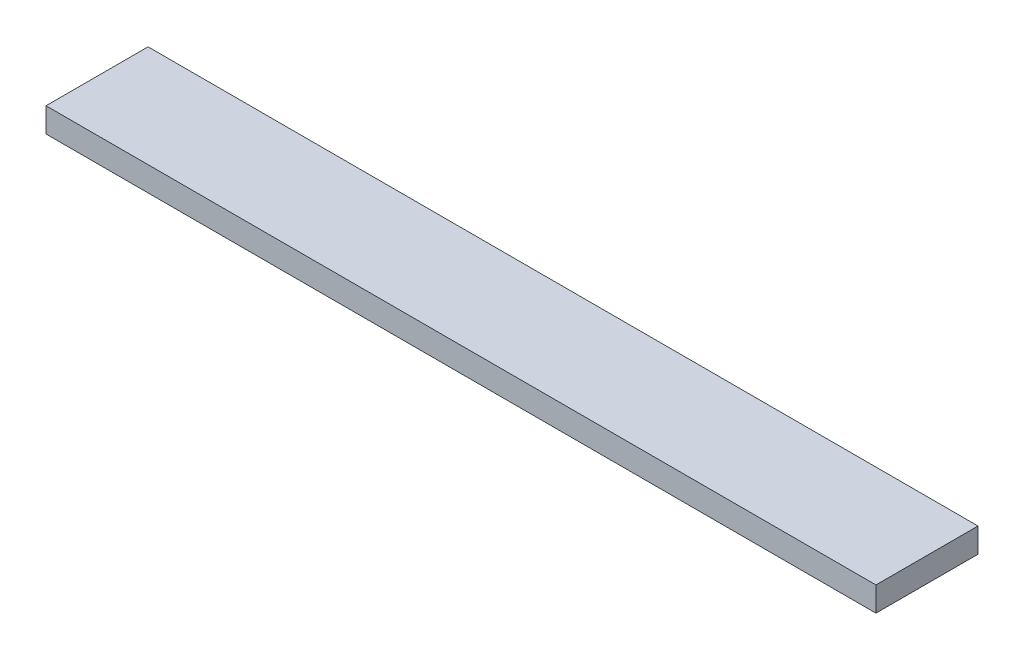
from build123d import *

# Parameters (mm, degrees)
SKETCH1_W      = 423.434288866
SKETCH1_H      = 12.488870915
EXTRUDE1_DEPTH = 52.07


with BuildPart() as part:
    # Sketch1 → Extrude1 (new body)
    with BuildSketch(Plane.XY):
        with Locations((211.717144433, 6.244435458)):
            Rectangle(SKETCH1_W, SKETCH1_H)
    extrude(amount=EXTRUDE1_DEPTH)


solid = part.part
